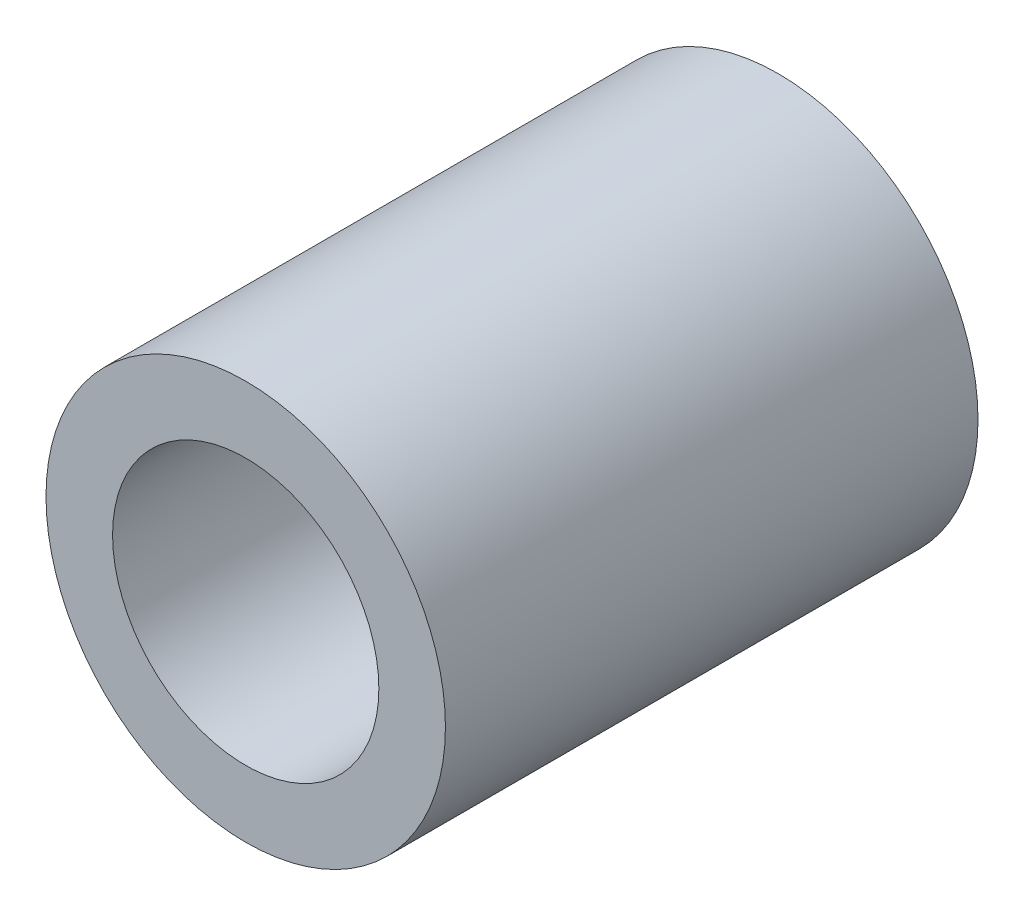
ISO-10303-21;
HEADER;
FILE_DESCRIPTION(('STEP AP214'),'2;1');
FILE_NAME('part.step','',(''),(''),'','','');
FILE_SCHEMA(('AUTOMOTIVE_DESIGN { 1 0 10303 214 1 1 1 1 }'));
ENDSEC;
DATA;
#1=APPLICATION_CONTEXT('core data for automotive mechanical design processes');
#2=APPLICATION_PROTOCOL_DEFINITION('international standard','automotive_design',2000,#1);
#3=PRODUCT_CONTEXT('',#1,'mechanical');
#4=PRODUCT('Part','Part','',(#3));
#5=PRODUCT_RELATED_PRODUCT_CATEGORY('part','',(#4));
#6=PRODUCT_DEFINITION_FORMATION('','',#4);
#7=PRODUCT_DEFINITION_CONTEXT('part definition',#1,'design');
#8=PRODUCT_DEFINITION('design','',#6,#7);
#9=PRODUCT_DEFINITION_SHAPE('','',#8);
#10=(LENGTH_UNIT() NAMED_UNIT(*) SI_UNIT(.MILLI.,.METRE.));
#11=(NAMED_UNIT(*) PLANE_ANGLE_UNIT() SI_UNIT($,.RADIAN.));
#12=(NAMED_UNIT(*) SI_UNIT($,.STERADIAN.) SOLID_ANGLE_UNIT());
#13=UNCERTAINTY_MEASURE_WITH_UNIT(LENGTH_MEASURE(1.E-05),#10,'distance_accuracy_value','');
#14=(GEOMETRIC_REPRESENTATION_CONTEXT(3) GLOBAL_UNCERTAINTY_ASSIGNED_CONTEXT((#13)) GLOBAL_UNIT_ASSIGNED_CONTEXT((#10,
#11,#12)) REPRESENTATION_CONTEXT('',''));
#15=CARTESIAN_POINT('',(0.,0.,0.));
#16=DIRECTION('',(0.,0.,1.));
#17=DIRECTION('',(1.,0.,0.));
#18=AXIS2_PLACEMENT_3D('',#15,#16,#17);
#19=CARTESIAN_POINT('',(0.,0.,-20.));
#20=DIRECTION('',(0.,0.,1.));
#21=DIRECTION('',(1.,0.,0.));
#22=AXIS2_PLACEMENT_3D('',#19,#20,#21);
#23=CYLINDRICAL_SURFACE('',#22,7.5);
#24=CARTESIAN_POINT('',(0.,0.,-20.));
#25=DIRECTION('',(0.,0.,1.));
#26=DIRECTION('',(1.,0.,0.));
#27=AXIS2_PLACEMENT_3D('',#24,#25,#26);
#28=CIRCLE('',#27,7.5);
#29=CARTESIAN_POINT('',(7.5,0.,-20.));
#30=VERTEX_POINT('',#29);
#31=EDGE_CURVE('E10',#30,#30,#28,.T.);
#32=ORIENTED_EDGE('',*,*,#31,.T.);
#33=EDGE_LOOP('',(#32));
#34=FACE_BOUND('',#33,.T.);
#35=CARTESIAN_POINT('',(0.,0.,0.));
#36=DIRECTION('',(0.,0.,1.));
#37=DIRECTION('',(1.,0.,0.));
#38=AXIS2_PLACEMENT_3D('',#35,#36,#37);
#39=CIRCLE('',#38,7.5);
#40=CARTESIAN_POINT('',(7.5,0.,0.));
#41=VERTEX_POINT('',#40);
#42=EDGE_CURVE('E33',#41,#41,#39,.T.);
#43=ORIENTED_EDGE('',*,*,#42,.F.);
#44=EDGE_LOOP('',(#43));
#45=FACE_BOUND('',#44,.T.);
#46=ADVANCED_FACE('F27',(#34,#45),#23,.T.);
#47=CARTESIAN_POINT('',(0.,0.,-20.));
#48=DIRECTION('',(0.,0.,1.));
#49=DIRECTION('',(1.,0.,0.));
#50=AXIS2_PLACEMENT_3D('',#47,#48,#49);
#51=PLANE('',#50);
#52=CARTESIAN_POINT('',(0.,0.,-20.));
#53=DIRECTION('',(0.,0.,1.));
#54=DIRECTION('',(1.,0.,0.));
#55=AXIS2_PLACEMENT_3D('',#52,#53,#54);
#56=CIRCLE('',#55,5.);
#57=CARTESIAN_POINT('',(5.,0.,-20.));
#58=VERTEX_POINT('',#57);
#59=EDGE_CURVE('E37',#58,#58,#56,.T.);
#60=ORIENTED_EDGE('',*,*,#59,.T.);
#61=EDGE_LOOP('',(#60));
#62=FACE_BOUND('',#61,.T.);
#63=ORIENTED_EDGE('',*,*,#31,.F.);
#64=EDGE_LOOP('',(#63));
#65=FACE_BOUND('',#64,.T.);
#66=ADVANCED_FACE('F51',(#62,#65),#51,.F.);
#67=CARTESIAN_POINT('',(0.,0.,0.));
#68=DIRECTION('',(0.,0.,1.));
#69=DIRECTION('',(1.,0.,0.));
#70=AXIS2_PLACEMENT_3D('',#67,#68,#69);
#71=PLANE('',#70);
#72=CARTESIAN_POINT('',(0.,0.,0.));
#73=DIRECTION('',(0.,0.,1.));
#74=DIRECTION('',(1.,0.,0.));
#75=AXIS2_PLACEMENT_3D('',#72,#73,#74);
#76=CIRCLE('',#75,5.);
#77=CARTESIAN_POINT('',(5.,0.,0.));
#78=VERTEX_POINT('',#77);
#79=EDGE_CURVE('E41',#78,#78,#76,.T.);
#80=ORIENTED_EDGE('',*,*,#79,.F.);
#81=EDGE_LOOP('',(#80));
#82=FACE_BOUND('',#81,.T.);
#83=ORIENTED_EDGE('',*,*,#42,.T.);
#84=EDGE_LOOP('',(#83));
#85=FACE_BOUND('',#84,.T.);
#86=ADVANCED_FACE('F49',(#82,#85),#71,.T.);
#87=CARTESIAN_POINT('',(0.,0.,-20.));
#88=DIRECTION('',(0.,0.,1.));
#89=DIRECTION('',(1.,0.,0.));
#90=AXIS2_PLACEMENT_3D('',#87,#88,#89);
#91=CYLINDRICAL_SURFACE('',#90,5.);
#92=ORIENTED_EDGE('',*,*,#59,.F.);
#93=EDGE_LOOP('',(#92));
#94=FACE_BOUND('',#93,.T.);
#95=ORIENTED_EDGE('',*,*,#79,.T.);
#96=EDGE_LOOP('',(#95));
#97=FACE_BOUND('',#96,.T.);
#98=ADVANCED_FACE('F47',(#94,#97),#91,.F.);
#99=CLOSED_SHELL('',(#46,#66,#86,#98));
#100=MANIFOLD_SOLID_BREP('B2',#99);
#101=ADVANCED_BREP_SHAPE_REPRESENTATION('',(#18,#100),#14);
#102=SHAPE_DEFINITION_REPRESENTATION(#9,#101);
ENDSEC;
END-ISO-10303-21;
